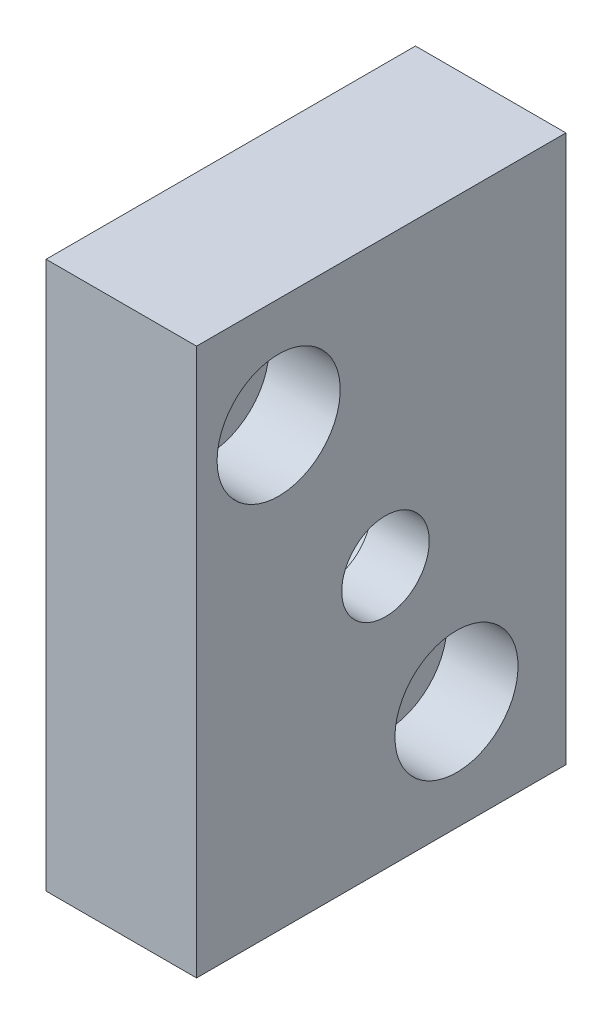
ISO-10303-21;
HEADER;
FILE_DESCRIPTION(('STEP AP214'),'2;1');
FILE_NAME('part.step','',(''),(''),'','','');
FILE_SCHEMA(('AUTOMOTIVE_DESIGN { 1 0 10303 214 1 1 1 1 }'));
ENDSEC;
DATA;
#1=APPLICATION_CONTEXT('core data for automotive mechanical design processes');
#2=APPLICATION_PROTOCOL_DEFINITION('international standard','automotive_design',2000,#1);
#3=PRODUCT_CONTEXT('',#1,'mechanical');
#4=PRODUCT('Part','Part','',(#3));
#5=PRODUCT_RELATED_PRODUCT_CATEGORY('part','',(#4));
#6=PRODUCT_DEFINITION_FORMATION('','',#4);
#7=PRODUCT_DEFINITION_CONTEXT('part definition',#1,'design');
#8=PRODUCT_DEFINITION('design','',#6,#7);
#9=PRODUCT_DEFINITION_SHAPE('','',#8);
#10=(LENGTH_UNIT() NAMED_UNIT(*) SI_UNIT(.MILLI.,.METRE.));
#11=(NAMED_UNIT(*) PLANE_ANGLE_UNIT() SI_UNIT($,.RADIAN.));
#12=(NAMED_UNIT(*) SI_UNIT($,.STERADIAN.) SOLID_ANGLE_UNIT());
#13=UNCERTAINTY_MEASURE_WITH_UNIT(LENGTH_MEASURE(1.E-05),#10,'distance_accuracy_value','');
#14=(GEOMETRIC_REPRESENTATION_CONTEXT(3) GLOBAL_UNCERTAINTY_ASSIGNED_CONTEXT((#13)) GLOBAL_UNIT_ASSIGNED_CONTEXT((#10,
#11,#12)) REPRESENTATION_CONTEXT('',''));
#15=CARTESIAN_POINT('',(0.,0.,0.));
#16=DIRECTION('',(0.,0.,1.));
#17=DIRECTION('',(1.,0.,0.));
#18=AXIS2_PLACEMENT_3D('',#15,#16,#17);
#19=CARTESIAN_POINT('',(-120.,-21.85,-2.00000000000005));
#20=DIRECTION('',(0.,0.,1.));
#21=DIRECTION('',(1.,0.,0.));
#22=AXIS2_PLACEMENT_3D('',#19,#20,#21);
#23=PLANE('',#22);
#24=DIRECTION('',(0.,-1.,0.));
#25=VECTOR('',#24,1.);
#26=CARTESIAN_POINT('',(-110.,-21.85,-2.00000000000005));
#27=LINE('',#26,#25);
#28=CARTESIAN_POINT('',(-110.,-21.85,-2.00000000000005));
#29=VERTEX_POINT('',#28);
#30=CARTESIAN_POINT('',(-110.,-61.85,-2.00000000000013));
#31=VERTEX_POINT('',#30);
#32=EDGE_CURVE('E67',#29,#31,#27,.T.);
#33=ORIENTED_EDGE('',*,*,#32,.F.);
#34=DIRECTION('',(1.,0.,0.));
#35=VECTOR('',#34,1.);
#36=CARTESIAN_POINT('',(-120.,-21.85,-2.00000000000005));
#37=LINE('',#36,#35);
#38=CARTESIAN_POINT('',(-121.,-21.85,-2.00000000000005));
#39=VERTEX_POINT('',#38);
#40=EDGE_CURVE('E52',#39,#29,#37,.T.);
#41=ORIENTED_EDGE('',*,*,#40,.F.);
#42=DIRECTION('',(0.,-1.,0.));
#43=VECTOR('',#42,1.);
#44=CARTESIAN_POINT('',(-121.,-21.85,-2.00000000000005));
#45=LINE('',#44,#43);
#46=CARTESIAN_POINT('',(-121.,-61.85,-2.00000000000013));
#47=VERTEX_POINT('',#46);
#48=EDGE_CURVE('E70',#39,#47,#45,.T.);
#49=ORIENTED_EDGE('',*,*,#48,.T.);
#50=DIRECTION('',(1.,0.,0.));
#51=VECTOR('',#50,1.);
#52=CARTESIAN_POINT('',(-120.,-61.85,-2.00000000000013));
#53=LINE('',#52,#51);
#54=EDGE_CURVE('E11',#47,#31,#53,.T.);
#55=ORIENTED_EDGE('',*,*,#54,.T.);
#56=EDGE_LOOP('',(#33,#41,#49,#55));
#57=FACE_BOUND('',#56,.T.);
#58=ADVANCED_FACE('F16',(#57),#23,.T.);
#59=CARTESIAN_POINT('',(-120.,-61.85,-2.00000000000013));
#60=DIRECTION('',(0.,-1.,0.));
#61=DIRECTION('',(0.,0.,-1.));
#62=AXIS2_PLACEMENT_3D('',#59,#60,#61);
#63=PLANE('',#62);
#64=DIRECTION('',(0.,0.,-1.));
#65=VECTOR('',#64,1.);
#66=CARTESIAN_POINT('',(-110.,-61.85,-2.00000000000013));
#67=LINE('',#66,#65);
#68=CARTESIAN_POINT('',(-110.,-61.8500000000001,-29.0000000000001));
#69=VERTEX_POINT('',#68);
#70=EDGE_CURVE('E73',#31,#69,#67,.T.);
#71=ORIENTED_EDGE('',*,*,#70,.F.);
#72=ORIENTED_EDGE('',*,*,#54,.F.);
#73=DIRECTION('',(0.,0.,-1.));
#74=VECTOR('',#73,1.);
#75=CARTESIAN_POINT('',(-121.,-61.85,-2.00000000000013));
#76=LINE('',#75,#74);
#77=CARTESIAN_POINT('',(-121.,-61.8500000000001,-29.0000000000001));
#78=VERTEX_POINT('',#77);
#79=EDGE_CURVE('E100',#47,#78,#76,.T.);
#80=ORIENTED_EDGE('',*,*,#79,.T.);
#81=DIRECTION('',(1.,0.,0.));
#82=VECTOR('',#81,1.);
#83=CARTESIAN_POINT('',(-120.,-61.8500000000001,-29.0000000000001));
#84=LINE('',#83,#82);
#85=EDGE_CURVE('E26',#78,#69,#84,.T.);
#86=ORIENTED_EDGE('',*,*,#85,.T.);
#87=EDGE_LOOP('',(#71,#72,#80,#86));
#88=FACE_BOUND('',#87,.T.);
#89=ADVANCED_FACE('F109',(#88),#63,.T.);
#90=CARTESIAN_POINT('',(-120.,-61.8500000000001,-29.0000000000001));
#91=DIRECTION('',(0.,0.,-1.));
#92=DIRECTION('',(-1.,0.,0.));
#93=AXIS2_PLACEMENT_3D('',#90,#91,#92);
#94=PLANE('',#93);
#95=DIRECTION('',(0.,1.,0.));
#96=VECTOR('',#95,1.);
#97=CARTESIAN_POINT('',(-110.,-61.8500000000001,-29.0000000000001));
#98=LINE('',#97,#96);
#99=CARTESIAN_POINT('',(-110.,-21.85,-29.));
#100=VERTEX_POINT('',#99);
#101=EDGE_CURVE('E69',#69,#100,#98,.T.);
#102=ORIENTED_EDGE('',*,*,#101,.F.);
#103=ORIENTED_EDGE('',*,*,#85,.F.);
#104=DIRECTION('',(0.,1.,0.));
#105=VECTOR('',#104,1.);
#106=CARTESIAN_POINT('',(-121.,-61.8500000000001,-29.0000000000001));
#107=LINE('',#106,#105);
#108=CARTESIAN_POINT('',(-121.,-21.85,-29.));
#109=VERTEX_POINT('',#108);
#110=EDGE_CURVE('E102',#78,#109,#107,.T.);
#111=ORIENTED_EDGE('',*,*,#110,.T.);
#112=DIRECTION('',(1.,0.,0.));
#113=VECTOR('',#112,1.);
#114=CARTESIAN_POINT('',(-120.,-21.85,-29.));
#115=LINE('',#114,#113);
#116=EDGE_CURVE('E34',#109,#100,#115,.T.);
#117=ORIENTED_EDGE('',*,*,#116,.T.);
#118=EDGE_LOOP('',(#102,#103,#111,#117));
#119=FACE_BOUND('',#118,.T.);
#120=ADVANCED_FACE('F105',(#119),#94,.T.);
#121=CARTESIAN_POINT('',(-120.,-21.85,-29.));
#122=DIRECTION('',(0.,1.,0.));
#123=DIRECTION('',(0.,0.,1.));
#124=AXIS2_PLACEMENT_3D('',#121,#122,#123);
#125=PLANE('',#124);
#126=DIRECTION('',(0.,0.,1.));
#127=VECTOR('',#126,1.);
#128=CARTESIAN_POINT('',(-110.,-21.85,-29.));
#129=LINE('',#128,#127);
#130=EDGE_CURVE('E55',#100,#29,#129,.T.);
#131=ORIENTED_EDGE('',*,*,#130,.F.);
#132=ORIENTED_EDGE('',*,*,#116,.F.);
#133=DIRECTION('',(0.,0.,1.));
#134=VECTOR('',#133,1.);
#135=CARTESIAN_POINT('',(-121.,-21.85,-29.));
#136=LINE('',#135,#134);
#137=EDGE_CURVE('E20',#109,#39,#136,.T.);
#138=ORIENTED_EDGE('',*,*,#137,.T.);
#139=ORIENTED_EDGE('',*,*,#40,.T.);
#140=EDGE_LOOP('',(#131,#132,#138,#139));
#141=FACE_BOUND('',#140,.T.);
#142=ADVANCED_FACE('F54',(#141),#125,.T.);
#143=CARTESIAN_POINT('',(-121.,-61.85,-2.00000000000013));
#144=DIRECTION('',(1.,0.,0.));
#145=DIRECTION('',(0.,0.,-1.));
#146=AXIS2_PLACEMENT_3D('',#143,#144,#145);
#147=PLANE('',#146);
#148=CARTESIAN_POINT('',(-121.,-42.687,-15.8100000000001));
#149=DIRECTION('',(-1.,0.,0.));
#150=DIRECTION('',(0.,-1.,0.));
#151=AXIS2_PLACEMENT_3D('',#148,#149,#150);
#152=CIRCLE('',#151,6.5);
#153=CARTESIAN_POINT('',(-121.,-49.187,-15.8100000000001));
#154=VERTEX_POINT('',#153);
#155=EDGE_CURVE('E89',#154,#154,#152,.T.);
#156=ORIENTED_EDGE('',*,*,#155,.F.);
#157=EDGE_LOOP('',(#156));
#158=FACE_BOUND('',#157,.T.);
#159=CARTESIAN_POINT('',(-121.,-29.85,-8.00000000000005));
#160=DIRECTION('',(1.,0.,0.));
#161=DIRECTION('',(0.,0.,-1.));
#162=AXIS2_PLACEMENT_3D('',#159,#160,#161);
#163=CIRCLE('',#162,2.75);
#164=CARTESIAN_POINT('',(-121.,-29.85,-10.75));
#165=VERTEX_POINT('',#164);
#166=EDGE_CURVE('E94',#165,#165,#163,.T.);
#167=ORIENTED_EDGE('',*,*,#166,.T.);
#168=EDGE_LOOP('',(#167));
#169=FACE_BOUND('',#168,.T.);
#170=CARTESIAN_POINT('',(-121.,-53.85,-21.0000000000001));
#171=DIRECTION('',(1.,0.,0.));
#172=DIRECTION('',(0.,0.,-1.));
#173=AXIS2_PLACEMENT_3D('',#170,#171,#172);
#174=CIRCLE('',#173,2.75);
#175=CARTESIAN_POINT('',(-121.,-53.85,-23.7500000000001));
#176=VERTEX_POINT('',#175);
#177=EDGE_CURVE('E74',#176,#176,#174,.T.);
#178=ORIENTED_EDGE('',*,*,#177,.T.);
#179=EDGE_LOOP('',(#178));
#180=FACE_BOUND('',#179,.T.);
#181=ORIENTED_EDGE('',*,*,#48,.F.);
#182=ORIENTED_EDGE('',*,*,#137,.F.);
#183=ORIENTED_EDGE('',*,*,#110,.F.);
#184=ORIENTED_EDGE('',*,*,#79,.F.);
#185=EDGE_LOOP('',(#181,#182,#183,#184));
#186=FACE_BOUND('',#185,.T.);
#187=ADVANCED_FACE('F18',(#158,#169,#180,#186),#147,.F.);
#188=CARTESIAN_POINT('',(-110.,-61.85,-2.00000000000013));
#189=DIRECTION('',(1.,0.,0.));
#190=DIRECTION('',(0.,0.,-1.));
#191=AXIS2_PLACEMENT_3D('',#188,#189,#190);
#192=PLANE('',#191);
#193=CARTESIAN_POINT('',(-110.,-42.687,-15.8100000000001));
#194=DIRECTION('',(1.,0.,0.));
#195=DIRECTION('',(0.,0.,-1.));
#196=AXIS2_PLACEMENT_3D('',#193,#194,#195);
#197=CIRCLE('',#196,3.2);
#198=CARTESIAN_POINT('',(-110.,-42.687,-19.0100000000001));
#199=VERTEX_POINT('',#198);
#200=EDGE_CURVE('E90',#199,#199,#197,.T.);
#201=ORIENTED_EDGE('',*,*,#200,.F.);
#202=EDGE_LOOP('',(#201));
#203=FACE_BOUND('',#202,.T.);
#204=CARTESIAN_POINT('',(-110.,-29.85,-8.00000000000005));
#205=DIRECTION('',(-1.,0.,0.));
#206=DIRECTION('',(0.,0.,1.));
#207=AXIS2_PLACEMENT_3D('',#204,#205,#206);
#208=CIRCLE('',#207,4.5);
#209=CARTESIAN_POINT('',(-110.,-29.85,-3.50000000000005));
#210=VERTEX_POINT('',#209);
#211=EDGE_CURVE('E169',#210,#210,#208,.T.);
#212=ORIENTED_EDGE('',*,*,#211,.T.);
#213=EDGE_LOOP('',(#212));
#214=FACE_BOUND('',#213,.T.);
#215=CARTESIAN_POINT('',(-110.,-53.85,-21.0000000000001));
#216=DIRECTION('',(-1.,0.,0.));
#217=DIRECTION('',(0.,0.,1.));
#218=AXIS2_PLACEMENT_3D('',#215,#216,#217);
#219=CIRCLE('',#218,4.5);
#220=CARTESIAN_POINT('',(-110.,-53.85,-16.5000000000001));
#221=VERTEX_POINT('',#220);
#222=EDGE_CURVE('E96',#221,#221,#219,.T.);
#223=ORIENTED_EDGE('',*,*,#222,.T.);
#224=EDGE_LOOP('',(#223));
#225=FACE_BOUND('',#224,.T.);
#226=ORIENTED_EDGE('',*,*,#32,.T.);
#227=ORIENTED_EDGE('',*,*,#70,.T.);
#228=ORIENTED_EDGE('',*,*,#101,.T.);
#229=ORIENTED_EDGE('',*,*,#130,.T.);
#230=EDGE_LOOP('',(#226,#227,#228,#229));
#231=FACE_BOUND('',#230,.T.);
#232=ADVANCED_FACE('F65',(#203,#214,#225,#231),#192,.T.);
#233=CARTESIAN_POINT('',(-138.675356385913,-53.85,-21.0000000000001));
#234=DIRECTION('',(-1.,0.,0.));
#235=DIRECTION('',(0.,0.,1.));
#236=AXIS2_PLACEMENT_3D('',#233,#234,#235);
#237=CYLINDRICAL_SURFACE('',#236,2.75);
#238=CARTESIAN_POINT('',(-115.2,-53.85,-21.0000000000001));
#239=DIRECTION('',(-1.,0.,0.));
#240=DIRECTION('',(0.,0.,1.));
#241=AXIS2_PLACEMENT_3D('',#238,#239,#240);
#242=CIRCLE('',#241,2.75);
#243=CARTESIAN_POINT('',(-115.2,-53.85,-18.2500000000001));
#244=VERTEX_POINT('',#243);
#245=EDGE_CURVE('E78',#244,#244,#242,.T.);
#246=ORIENTED_EDGE('',*,*,#245,.F.);
#247=EDGE_LOOP('',(#246));
#248=FACE_BOUND('',#247,.T.);
#249=ORIENTED_EDGE('',*,*,#177,.F.);
#250=EDGE_LOOP('',(#249));
#251=FACE_BOUND('',#250,.T.);
#252=ADVANCED_FACE('F123',(#248,#251),#237,.F.);
#253=CARTESIAN_POINT('',(-115.2,-53.85,-21.0000000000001));
#254=DIRECTION('',(-1.,0.,0.));
#255=DIRECTION('',(0.,0.,1.));
#256=AXIS2_PLACEMENT_3D('',#253,#254,#255);
#257=PLANE('',#256);
#258=ORIENTED_EDGE('',*,*,#245,.T.);
#259=EDGE_LOOP('',(#258));
#260=FACE_BOUND('',#259,.T.);
#261=CARTESIAN_POINT('',(-115.2,-53.85,-21.0000000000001));
#262=DIRECTION('',(-1.,0.,0.));
#263=DIRECTION('',(0.,0.,1.));
#264=AXIS2_PLACEMENT_3D('',#261,#262,#263);
#265=CIRCLE('',#264,4.5);
#266=CARTESIAN_POINT('',(-115.2,-53.85,-16.5000000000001));
#267=VERTEX_POINT('',#266);
#268=EDGE_CURVE('E178',#267,#267,#265,.T.);
#269=ORIENTED_EDGE('',*,*,#268,.F.);
#270=EDGE_LOOP('',(#269));
#271=FACE_BOUND('',#270,.T.);
#272=ADVANCED_FACE('F129',(#260,#271),#257,.F.);
#273=CARTESIAN_POINT('',(-110.,-53.85,-21.0000000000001));
#274=DIRECTION('',(-1.,0.,0.));
#275=DIRECTION('',(0.,0.,1.));
#276=AXIS2_PLACEMENT_3D('',#273,#274,#275);
#277=CYLINDRICAL_SURFACE('',#276,4.5);
#278=ORIENTED_EDGE('',*,*,#268,.T.);
#279=EDGE_LOOP('',(#278));
#280=FACE_BOUND('',#279,.T.);
#281=ORIENTED_EDGE('',*,*,#222,.F.);
#282=EDGE_LOOP('',(#281));
#283=FACE_BOUND('',#282,.T.);
#284=ADVANCED_FACE('F125',(#280,#283),#277,.F.);
#285=CARTESIAN_POINT('',(-138.119742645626,-29.85,-8.00000000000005));
#286=DIRECTION('',(-1.,0.,0.));
#287=DIRECTION('',(0.,0.,1.));
#288=AXIS2_PLACEMENT_3D('',#285,#286,#287);
#289=CYLINDRICAL_SURFACE('',#288,2.75);
#290=CARTESIAN_POINT('',(-115.2,-29.85,-8.00000000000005));
#291=DIRECTION('',(-1.,0.,0.));
#292=DIRECTION('',(0.,0.,1.));
#293=AXIS2_PLACEMENT_3D('',#290,#291,#292);
#294=CIRCLE('',#293,2.75);
#295=CARTESIAN_POINT('',(-115.2,-29.85,-5.25000000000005));
#296=VERTEX_POINT('',#295);
#297=EDGE_CURVE('E97',#296,#296,#294,.T.);
#298=ORIENTED_EDGE('',*,*,#297,.F.);
#299=EDGE_LOOP('',(#298));
#300=FACE_BOUND('',#299,.T.);
#301=ORIENTED_EDGE('',*,*,#166,.F.);
#302=EDGE_LOOP('',(#301));
#303=FACE_BOUND('',#302,.T.);
#304=ADVANCED_FACE('F128',(#300,#303),#289,.F.);
#305=CARTESIAN_POINT('',(-115.2,-29.85,-8.00000000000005));
#306=DIRECTION('',(-1.,0.,0.));
#307=DIRECTION('',(0.,0.,1.));
#308=AXIS2_PLACEMENT_3D('',#305,#306,#307);
#309=PLANE('',#308);
#310=ORIENTED_EDGE('',*,*,#297,.T.);
#311=EDGE_LOOP('',(#310));
#312=FACE_BOUND('',#311,.T.);
#313=CARTESIAN_POINT('',(-115.2,-29.85,-8.00000000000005));
#314=DIRECTION('',(-1.,0.,0.));
#315=DIRECTION('',(0.,0.,1.));
#316=AXIS2_PLACEMENT_3D('',#313,#314,#315);
#317=CIRCLE('',#316,4.5);
#318=CARTESIAN_POINT('',(-115.2,-29.85,-3.50000000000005));
#319=VERTEX_POINT('',#318);
#320=EDGE_CURVE('E172',#319,#319,#317,.T.);
#321=ORIENTED_EDGE('',*,*,#320,.F.);
#322=EDGE_LOOP('',(#321));
#323=FACE_BOUND('',#322,.T.);
#324=ADVANCED_FACE('F141',(#312,#323),#309,.F.);
#325=CARTESIAN_POINT('',(-110.,-29.85,-8.00000000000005));
#326=DIRECTION('',(-1.,0.,0.));
#327=DIRECTION('',(0.,0.,1.));
#328=AXIS2_PLACEMENT_3D('',#325,#326,#327);
#329=CYLINDRICAL_SURFACE('',#328,4.5);
#330=ORIENTED_EDGE('',*,*,#320,.T.);
#331=EDGE_LOOP('',(#330));
#332=FACE_BOUND('',#331,.T.);
#333=ORIENTED_EDGE('',*,*,#211,.F.);
#334=EDGE_LOOP('',(#333));
#335=FACE_BOUND('',#334,.T.);
#336=ADVANCED_FACE('F137',(#332,#335),#329,.F.);
#337=CARTESIAN_POINT('',(-114.2,-42.687,-15.8100000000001));
#338=DIRECTION('',(-1.,0.,0.));
#339=DIRECTION('',(0.,0.,1.));
#340=AXIS2_PLACEMENT_3D('',#337,#338,#339);
#341=CYLINDRICAL_SURFACE('',#340,6.5);
#342=CARTESIAN_POINT('',(-114.2,-42.687,-15.8100000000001));
#343=DIRECTION('',(-1.,0.,0.));
#344=DIRECTION('',(0.,-1.,0.));
#345=AXIS2_PLACEMENT_3D('',#342,#343,#344);
#346=CIRCLE('',#345,6.5);
#347=CARTESIAN_POINT('',(-114.2,-49.187,-15.8100000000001));
#348=VERTEX_POINT('',#347);
#349=EDGE_CURVE('E93',#348,#348,#346,.T.);
#350=ORIENTED_EDGE('',*,*,#349,.F.);
#351=EDGE_LOOP('',(#350));
#352=FACE_BOUND('',#351,.T.);
#353=ORIENTED_EDGE('',*,*,#155,.T.);
#354=EDGE_LOOP('',(#353));
#355=FACE_BOUND('',#354,.T.);
#356=ADVANCED_FACE('F140',(#352,#355),#341,.F.);
#357=CARTESIAN_POINT('',(-114.2,-42.687,-15.8100000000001));
#358=DIRECTION('',(-1.,0.,0.));
#359=DIRECTION('',(0.,0.,1.));
#360=AXIS2_PLACEMENT_3D('',#357,#358,#359);
#361=PLANE('',#360);
#362=CARTESIAN_POINT('',(-114.2,-42.687,-15.8100000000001));
#363=DIRECTION('',(-1.,0.,0.));
#364=DIRECTION('',(0.,0.,1.));
#365=AXIS2_PLACEMENT_3D('',#362,#363,#364);
#366=CIRCLE('',#365,3.2);
#367=CARTESIAN_POINT('',(-114.2,-42.687,-12.6100000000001));
#368=VERTEX_POINT('',#367);
#369=EDGE_CURVE('E86',#368,#368,#366,.T.);
#370=ORIENTED_EDGE('',*,*,#369,.F.);
#371=EDGE_LOOP('',(#370));
#372=FACE_BOUND('',#371,.T.);
#373=ORIENTED_EDGE('',*,*,#349,.T.);
#374=EDGE_LOOP('',(#373));
#375=FACE_BOUND('',#374,.T.);
#376=ADVANCED_FACE('F151',(#372,#375),#361,.T.);
#377=CARTESIAN_POINT('',(-194.700055,-42.687,-15.8100000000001));
#378=DIRECTION('',(1.,0.,0.));
#379=DIRECTION('',(0.,0.,-1.));
#380=AXIS2_PLACEMENT_3D('',#377,#378,#379);
#381=CYLINDRICAL_SURFACE('',#380,3.2);
#382=ORIENTED_EDGE('',*,*,#369,.T.);
#383=EDGE_LOOP('',(#382));
#384=FACE_BOUND('',#383,.T.);
#385=ORIENTED_EDGE('',*,*,#200,.T.);
#386=EDGE_LOOP('',(#385));
#387=FACE_BOUND('',#386,.T.);
#388=ADVANCED_FACE('F155',(#384,#387),#381,.F.);
#389=CLOSED_SHELL('',(#58,#89,#120,#142,#187,#232,#252,#272,#284,#304,#324,#336,#356,#376,#388));
#390=MANIFOLD_SOLID_BREP('B1',#389);
#391=ADVANCED_BREP_SHAPE_REPRESENTATION('',(#18,#390),#14);
#392=SHAPE_DEFINITION_REPRESENTATION(#9,#391);
ENDSEC;
END-ISO-10303-21;
